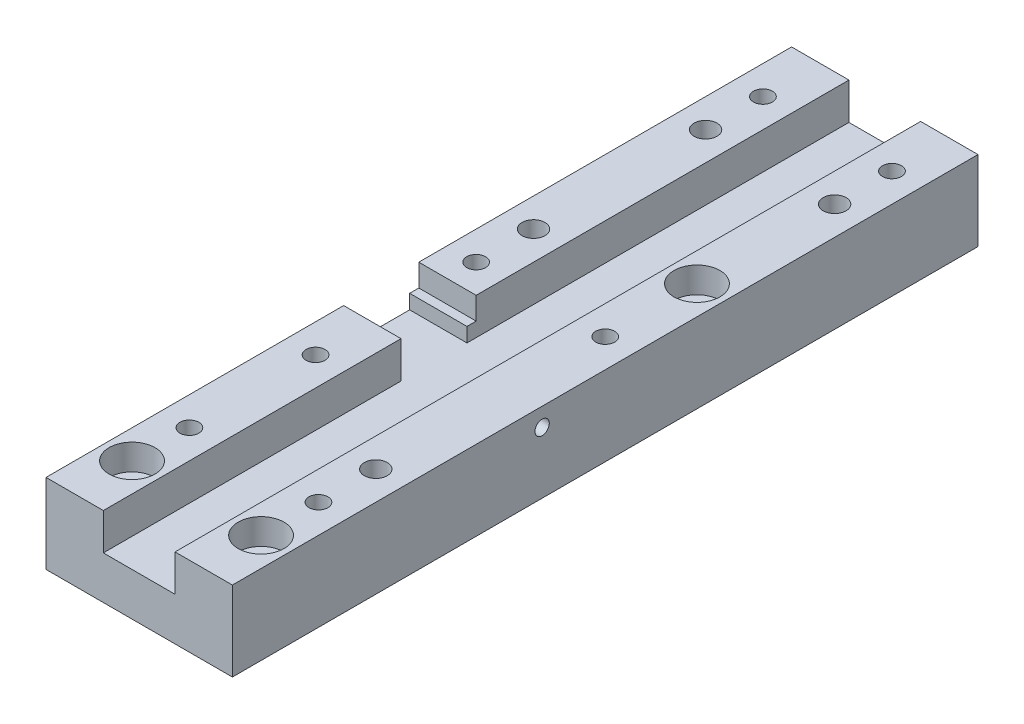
from build123d import *

# Parameters (mm, degrees)
EXTRUDE_1_DEPTH     = 130
SKETCH_2_R          = 1.25
CUT_EXTRUDE_1_DEPTH = 20
SKETCH_3_R          = 1.65
SKETCH_3_R_2        = 2
SKETCH_3_R_3        = 2.25
CUT_EXTRUDE_2_DEPTH = 20
SKETCH_4_R          = 4
CUT_EXTRUDE_3_DEPTH = 4.5
SKETCH_5_W          = 10
SKETCH_5_H          = 11.5
CUT_EXTRUDE_4_DEPTH = 6.4
SKETCH_6_W          = 10
SKETCH_6_H          = 1.6
CUT_EXTRUDE_5_DEPTH = 3.9


with BuildPart() as part:
    # Sketch 1 → Extrude 1 (new body)
    with BuildSketch(Plane.XY):
        Polygon((10, 7.5), (10, 13.9), (0, 13.9), (0, 0), (32.5, 0), (32.5, 13.9), (22.5, 13.9), (22.5, 7.5), align=None)
    extrude(amount=EXTRUDE_1_DEPTH)

    # Sketch 2 → Cut-Extrude 1 (cut)
    with BuildSketch(Plane(origin=(32.5, 0, 0), x_dir=(0, 0, -1), z_dir=(1, 0, 0))):
        with Locations((-76, 10.7)):
            Circle(SKETCH_2_R)
    extrude(amount=-CUT_EXTRUDE_1_DEPTH, mode=Mode.SUBTRACT)

    # Sketch 3 → Cut-Extrude 2 (cut)
    with BuildSketch(Plane(origin=(0, 13.9, 0), x_dir=(1, 0, 0), z_dir=(0, 1, 0))):
        with Locations(Location((27.5, -110, 0), (0, 0, 270))):
            Circle(SKETCH_3_R)
        with Locations(Location((27.5, -60, 0), (0, 0, 270))):
            Circle(SKETCH_3_R)
        with Locations(Location((27.5, -10, 0), (0, 0, 270))):
            Circle(SKETCH_3_R)
        with Locations(Location((5, -10, 0), (0, 0, 270))):
            Circle(SKETCH_3_R)
        with Locations(Location((5, -60, 0), (0, 0, 270))):
            Circle(SKETCH_3_R)
        with Locations(Location((5, -88, 0), (0, 0, 270))):
            Circle(SKETCH_3_R)
        with Locations(Location((5, -110, 0), (0, 0, 270))):
            Circle(SKETCH_3_R)
        with Locations(Location((27.5, -20, 0), (0, 0, 270))):
            Circle(SKETCH_3_R_2)
        with Locations(Location((27.5, -100, 0), (0, 0, 270))):
            Circle(SKETCH_3_R_2)
        with Locations(Location((5, -50, 0), (0, 0, 270))):
            Circle(SKETCH_3_R_2)
        with Locations(Location((5, -20, 0), (0, 0, 270))):
            Circle(SKETCH_3_R_2)
        with Locations(Location((27.5, -44, 0), (0, 0, 270))):
            Circle(SKETCH_3_R_3)
        with Locations(Location((27.5, -120, 0), (0, 0, 270))):
            Circle(SKETCH_3_R_3)
        with Locations(Location((5, -120, 0), (0, 0, 270))):
            Circle(SKETCH_3_R_3)
    extrude(amount=-CUT_EXTRUDE_2_DEPTH, mode=Mode.SUBTRACT)

    # Sketch 4 → Cut-Extrude 3 (cut)
    with BuildSketch(Plane(origin=(0, 13.9, 0), x_dir=(1, 0, 0), z_dir=(0, 1, 0))):
        with Locations(Location((27.5, -44, 0), (0, 0, 270))):
            Circle(SKETCH_4_R)
        with Locations(Location((27.5, -120, 0), (0, 0, 270))):
            Circle(SKETCH_4_R)
        with Locations(Location((5, -120, 0), (0, 0, 270))):
            Circle(SKETCH_4_R)
    extrude(amount=-CUT_EXTRUDE_3_DEPTH, mode=Mode.SUBTRACT)

    # Sketch 5 → Cut-Extrude 4 (cut)
    with BuildSketch(Plane(origin=(0, 13.9, 0), x_dir=(1, 0, 0), z_dir=(0, 1, 0))):
        with Locations((5, -72.35)):
            Rectangle(SKETCH_5_W, SKETCH_5_H)
    extrude(amount=-CUT_EXTRUDE_4_DEPTH, mode=Mode.SUBTRACT)

    # Sketch 6 → Cut-Extrude 5 (cut)
    with BuildSketch(Plane(origin=(0, 13.9, 0), x_dir=(1, 0, 0), z_dir=(0, 1, 0))):
        with Locations((5, -65.8)):
            Rectangle(SKETCH_6_W, SKETCH_6_H)
    extrude(amount=-CUT_EXTRUDE_5_DEPTH, mode=Mode.SUBTRACT)


solid = part.part
